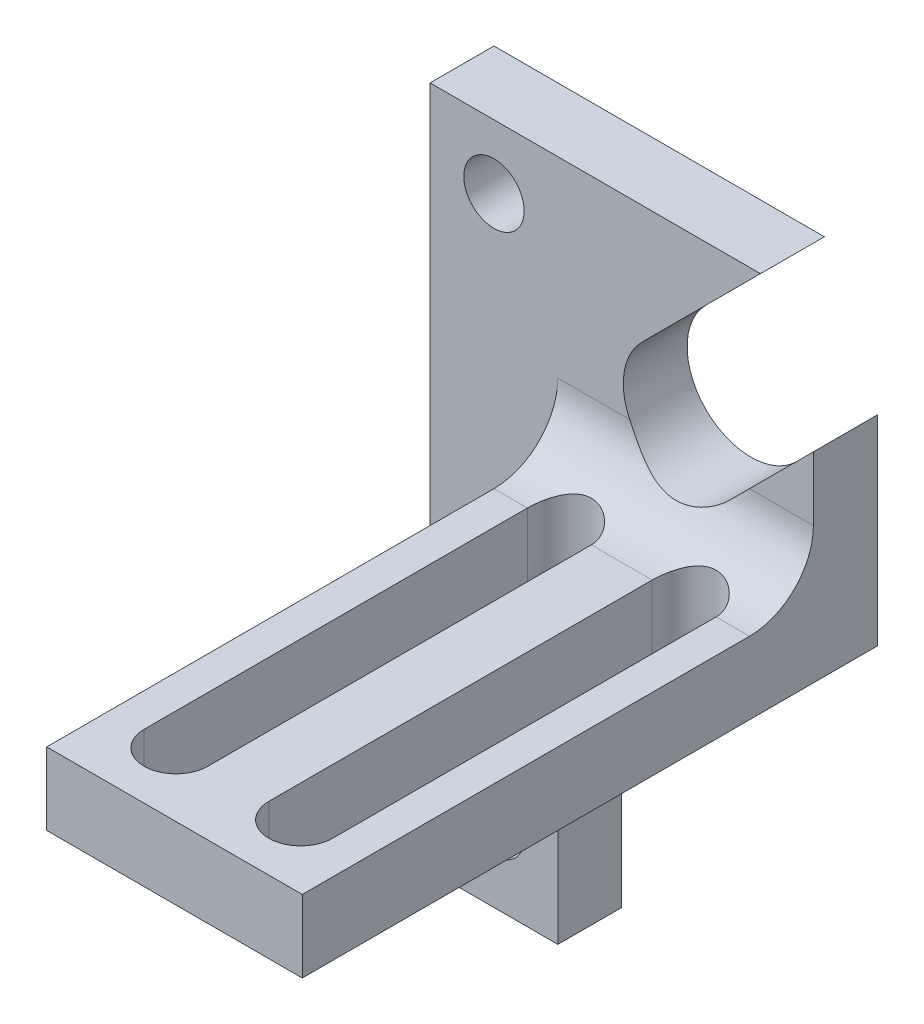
ISO-10303-21;
HEADER;
FILE_DESCRIPTION(('STEP AP214'),'2;1');
FILE_NAME('part.step','',(''),(''),'','','');
FILE_SCHEMA(('AUTOMOTIVE_DESIGN { 1 0 10303 214 1 1 1 1 }'));
ENDSEC;
DATA;
#1=APPLICATION_CONTEXT('core data for automotive mechanical design processes');
#2=APPLICATION_PROTOCOL_DEFINITION('international standard','automotive_design',2000,#1);
#3=PRODUCT_CONTEXT('',#1,'mechanical');
#4=PRODUCT('Part','Part','',(#3));
#5=PRODUCT_RELATED_PRODUCT_CATEGORY('part','',(#4));
#6=PRODUCT_DEFINITION_FORMATION('','',#4);
#7=PRODUCT_DEFINITION_CONTEXT('part definition',#1,'design');
#8=PRODUCT_DEFINITION('design','',#6,#7);
#9=PRODUCT_DEFINITION_SHAPE('','',#8);
#10=(LENGTH_UNIT() NAMED_UNIT(*) SI_UNIT(.MILLI.,.METRE.));
#11=(NAMED_UNIT(*) PLANE_ANGLE_UNIT() SI_UNIT($,.RADIAN.));
#12=(NAMED_UNIT(*) SI_UNIT($,.STERADIAN.) SOLID_ANGLE_UNIT());
#13=UNCERTAINTY_MEASURE_WITH_UNIT(LENGTH_MEASURE(1.E-05),#10,'distance_accuracy_value','');
#14=(GEOMETRIC_REPRESENTATION_CONTEXT(3) GLOBAL_UNCERTAINTY_ASSIGNED_CONTEXT((#13)) GLOBAL_UNIT_ASSIGNED_CONTEXT((#10,
#11,#12)) REPRESENTATION_CONTEXT('',''));
#15=CARTESIAN_POINT('',(0.,0.,0.));
#16=DIRECTION('',(0.,0.,1.));
#17=DIRECTION('',(1.,0.,0.));
#18=AXIS2_PLACEMENT_3D('',#15,#16,#17);
#19=CARTESIAN_POINT('',(-5.00375408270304,-19.1239826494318,12.7));
#20=DIRECTION('',(-1.,0.,0.));
#21=DIRECTION('',(0.,-1.,0.));
#22=AXIS2_PLACEMENT_3D('',#19,#20,#21);
#23=CYLINDRICAL_SURFACE('',#22,6.35);
#24=CARTESIAN_POINT('',(-23.2614148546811,-19.1239826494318,6.35));
#25=CARTESIAN_POINT('',(-23.1884676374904,-19.2737946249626,6.34997558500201));
#26=CARTESIAN_POINT('',(-23.1096050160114,-19.4206151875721,6.35529939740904));
#27=CARTESIAN_POINT('',(-22.9410293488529,-19.7069764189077,6.37519951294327));
#28=CARTESIAN_POINT('',(-22.8513313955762,-19.8465268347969,6.38976306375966));
#29=CARTESIAN_POINT('',(-22.6625957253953,-20.1164169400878,6.42656301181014));
#30=CARTESIAN_POINT('',(-22.5636359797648,-20.2468197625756,6.448738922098));
#31=CARTESIAN_POINT('',(-22.3565929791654,-20.4989302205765,6.49931056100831));
#32=CARTESIAN_POINT('',(-22.2485066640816,-20.6206349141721,6.52770838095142));
#33=CARTESIAN_POINT('',(-22.0245667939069,-20.8541816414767,6.5890741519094));
#34=CARTESIAN_POINT('',(-21.9087559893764,-20.9660711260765,6.62201787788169));
#35=CARTESIAN_POINT('',(-21.6695619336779,-21.180282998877,6.69110640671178));
#36=CARTESIAN_POINT('',(-21.5461793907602,-21.2826062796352,6.7272509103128));
#37=CARTESIAN_POINT('',(-21.1647799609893,-21.575364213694,6.83852865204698));
#38=CARTESIAN_POINT('',(-20.8960483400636,-21.7510293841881,6.91634663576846));
#39=CARTESIAN_POINT('',(-20.2990845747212,-22.0795966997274,7.07644615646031));
#40=CARTESIAN_POINT('',(-19.9676039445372,-22.2269981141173,7.15808976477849));
#41=CARTESIAN_POINT('',(-19.452447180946,-22.4047601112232,7.26274917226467));
#42=CARTESIAN_POINT('',(-19.2778238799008,-22.456776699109,7.29465732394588));
#43=CARTESIAN_POINT('',(-18.923509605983,-22.5458194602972,7.35057806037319));
#44=CARTESIAN_POINT('',(-18.7438194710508,-22.582848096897,7.37459194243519));
#45=CARTESIAN_POINT('',(-18.3917889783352,-22.639535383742,7.41185562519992));
#46=CARTESIAN_POINT('',(-18.2196541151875,-22.6601025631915,7.42566459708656));
#47=CARTESIAN_POINT('',(-17.8737742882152,-22.6870825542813,7.4438521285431));
#48=CARTESIAN_POINT('',(-17.7000294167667,-22.69349617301,7.448231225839));
#49=CARTESIAN_POINT('',(-17.3526850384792,-22.6920457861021,7.44724596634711));
#50=CARTESIAN_POINT('',(-17.1790855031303,-22.6841862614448,7.44188466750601));
#51=CARTESIAN_POINT('',(-16.833666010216,-22.6543492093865,7.42180598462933));
#52=CARTESIAN_POINT('',(-16.6618459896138,-22.6323721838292,7.40708893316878));
#53=CARTESIAN_POINT('',(-16.3451682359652,-22.5786969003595,7.37193121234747));
#54=CARTESIAN_POINT('',(-16.1998839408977,-22.5487756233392,7.35257116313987));
#55=CARTESIAN_POINT('',(-15.912504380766,-22.4790825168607,7.30857167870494));
#56=CARTESIAN_POINT('',(-15.7704101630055,-22.439307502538,7.28393053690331));
#57=CARTESIAN_POINT('',(-15.3496677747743,-22.3056295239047,7.20359533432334));
#58=CARTESIAN_POINT('',(-15.0766223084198,-22.1973843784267,7.14149720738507));
#59=CARTESIAN_POINT('',(-14.6643309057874,-22.0002346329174,7.03818776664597));
#60=CARTESIAN_POINT('',(-14.5184545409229,-21.9233312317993,6.99961095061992));
#61=CARTESIAN_POINT('',(-14.2332743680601,-21.7585458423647,6.92159979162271));
#62=CARTESIAN_POINT('',(-14.0939712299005,-21.6706627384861,6.88216536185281));
#63=CARTESIAN_POINT('',(-13.6870509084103,-21.3912024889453,6.76511542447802));
#64=CARTESIAN_POINT('',(-13.4297844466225,-21.1835086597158,6.68858047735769));
#65=CARTESIAN_POINT('',(-13.0774244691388,-20.8502444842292,6.58814352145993));
#66=CARTESIAN_POINT('',(-12.9691357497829,-20.7401000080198,6.55797131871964));
#67=CARTESIAN_POINT('',(-12.7603370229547,-20.5115445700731,6.50234024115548));
#68=CARTESIAN_POINT('',(-12.6598246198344,-20.3931361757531,6.47687991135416));
#69=CARTESIAN_POINT('',(-12.4668475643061,-20.1480145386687,6.43187111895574));
#70=CARTESIAN_POINT('',(-12.3744189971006,-20.021268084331,6.41234828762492));
#71=CARTESIAN_POINT('',(-12.1987237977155,-19.7605156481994,6.38061395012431));
#72=CARTESIAN_POINT('',(-12.115467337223,-19.6265018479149,6.36841049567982));
#73=CARTESIAN_POINT('',(-12.0372156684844,-19.4892902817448,6.36051655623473));
#74=B_SPLINE_CURVE_WITH_KNOTS('',3,(#24,#25,#26,#27,#28,#29,#30,#31,#32,#33,#34,#35,#36,#37,#38,
#39,#40,#41,#42,#43,#44,#45,#46,#47,#48,#49,#50,#51,#52,#53,#54,#55,#56,#57,#58,#59,#60,#61,#62,
#63,#64,#65,#66,#67,#68,#69,#70,#71,#72,#73),.UNSPECIFIED.,.F.,.F.,(4,2,2,2,2,2,2,2,2,2,2,2,2,2,
2,2,2,2,2,2,2,2,2,2,4),(0.,0.49952447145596,0.998361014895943,1.49332224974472,1.98845010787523,
2.48103460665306,2.97357309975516,3.96099686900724,5.07051978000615,5.62476867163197,
6.17892643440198,6.69985045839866,7.22074477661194,7.74147559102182,8.26218789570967,
8.71048463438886,9.15892645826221,10.0559996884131,10.5636665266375,11.071384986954,
12.0846567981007,12.5564451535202,13.028087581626,13.5017380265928,13.9759085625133),.UNSPECIFIED.);
#75=CARTESIAN_POINT('',(-23.2614148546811,-19.1239826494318,6.35));
#76=VERTEX_POINT('',#75);
#77=CARTESIAN_POINT('',(-13.062725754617,-20.8329543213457,6.58428942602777));
#78=VERTEX_POINT('',#77);
#79=EDGE_CURVE('E434',#76,#78,#74,.T.);
#80=ORIENTED_EDGE('',*,*,#79,.F.);
#81=DIRECTION('',(-1.,0.,0.));
#82=VECTOR('',#81,1.);
#83=CARTESIAN_POINT('',(-17.5528538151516,-19.1239826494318,6.35));
#84=LINE('',#83,#82);
#85=CARTESIAN_POINT('',(-30.403754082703,-19.1239826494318,6.35));
#86=VERTEX_POINT('',#85);
#87=EDGE_CURVE('E351',#86,#76,#84,.F.);
#88=ORIENTED_EDGE('',*,*,#87,.F.);
#89=CARTESIAN_POINT('',(-30.403754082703,-19.1239826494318,12.7));
#90=DIRECTION('',(-1.,0.,0.));
#91=DIRECTION('',(0.,0.,1.));
#92=AXIS2_PLACEMENT_3D('',#89,#90,#91);
#93=CIRCLE('',#92,6.35);
#94=CARTESIAN_POINT('',(-30.403754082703,-25.4739826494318,12.7));
#95=VERTEX_POINT('',#94);
#96=EDGE_CURVE('E43',#86,#95,#93,.T.);
#97=ORIENTED_EDGE('',*,*,#96,.T.);
#98=DIRECTION('',(-1.,0.,0.));
#99=VECTOR('',#98,1.);
#100=CARTESIAN_POINT('',(-5.00375408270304,-25.4739826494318,12.7));
#101=LINE('',#100,#99);
#102=CARTESIAN_POINT('',(-27.0778538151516,-25.4739826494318,12.7));
#103=VERTEX_POINT('',#102);
#104=EDGE_CURVE('E335',#103,#95,#101,.T.);
#105=ORIENTED_EDGE('',*,*,#104,.F.);
#106=CARTESIAN_POINT('',(-20.7278538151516,-25.4739826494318,12.7));
#107=CARTESIAN_POINT('',(-20.727840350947,-25.4739975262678,12.6161868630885));
#108=CARTESIAN_POINT('',(-20.7311721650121,-25.4723236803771,12.5323832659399));
#109=CARTESIAN_POINT('',(-20.7444217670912,-25.4657101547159,12.3654607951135));
#110=CARTESIAN_POINT('',(-20.7543369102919,-25.4607717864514,12.2823416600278));
#111=CARTESIAN_POINT('',(-20.7805893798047,-25.4477700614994,12.1177575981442));
#112=CARTESIAN_POINT('',(-20.7968975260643,-25.4397209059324,12.0362868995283));
#113=CARTESIAN_POINT('',(-20.8357353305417,-25.4207125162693,11.8752078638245));
#114=CARTESIAN_POINT('',(-20.858265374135,-25.4097531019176,11.7955996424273));
#115=CARTESIAN_POINT('',(-20.934794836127,-25.3729198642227,11.5605632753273));
#116=CARTESIAN_POINT('',(-20.9977897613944,-25.3430620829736,11.4085777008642));
#117=CARTESIAN_POINT('',(-21.1455040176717,-25.275450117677,11.1174756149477));
#118=CARTESIAN_POINT('',(-21.2302450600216,-25.2376880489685,10.978372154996));
#119=CARTESIAN_POINT('',(-21.4248269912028,-25.1550918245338,10.7076616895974));
#120=CARTESIAN_POINT('',(-21.5358685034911,-25.1099693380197,10.5770047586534));
#121=CARTESIAN_POINT('',(-21.7772644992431,-25.0186830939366,10.3353150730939));
#122=CARTESIAN_POINT('',(-21.9076315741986,-24.9725186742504,10.2242952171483));
#123=CARTESIAN_POINT('',(-22.1962764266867,-24.8802184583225,10.0163110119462));
#124=CARTESIAN_POINT('',(-22.3559351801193,-24.8343630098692,9.92110649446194));
#125=CARTESIAN_POINT('',(-22.607406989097,-24.7731790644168,9.79980415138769));
#126=CARTESIAN_POINT('',(-22.6932580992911,-24.7540459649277,9.76294561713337));
#127=CARTESIAN_POINT('',(-22.8684416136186,-24.7190283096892,9.69677421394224));
#128=CARTESIAN_POINT('',(-22.9577719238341,-24.7031418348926,9.66745688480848));
#129=CARTESIAN_POINT('',(-23.133863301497,-24.6761089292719,9.61825766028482));
#130=CARTESIAN_POINT('',(-23.2204624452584,-24.6647372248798,9.59791922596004));
#131=CARTESIAN_POINT('',(-23.3954367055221,-24.6459196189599,9.56454473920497));
#132=CARTESIAN_POINT('',(-23.4838108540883,-24.6384716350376,9.55150481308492));
#133=CARTESIAN_POINT('',(-23.6615549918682,-24.6278216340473,9.53292326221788));
#134=CARTESIAN_POINT('',(-23.7509243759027,-24.6246171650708,9.52737730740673));
#135=CARTESIAN_POINT('',(-23.9298323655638,-24.6225805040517,9.52385216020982));
#136=CARTESIAN_POINT('',(-24.0193709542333,-24.6237478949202,9.52587224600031));
#137=CARTESIAN_POINT('',(-24.265604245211,-24.632974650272,9.54188087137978));
#138=CARTESIAN_POINT('',(-24.4217006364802,-24.6455916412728,9.56378822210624));
#139=CARTESIAN_POINT('',(-24.7275053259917,-24.6826483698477,9.62996393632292));
#140=CARTESIAN_POINT('',(-24.8772117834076,-24.7070914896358,9.67423869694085));
#141=CARTESIAN_POINT('',(-25.1703927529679,-24.7655604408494,9.7846830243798));
#142=CARTESIAN_POINT('',(-25.3136411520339,-24.7997960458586,9.85133815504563));
#143=CARTESIAN_POINT('',(-25.5876101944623,-24.8740123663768,10.0042854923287));
#144=CARTESIAN_POINT('',(-25.7183242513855,-24.9139960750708,10.0905879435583));
#145=CARTESIAN_POINT('',(-25.9809663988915,-25.0013282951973,10.2931487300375));
#146=CARTESIAN_POINT('',(-26.1109462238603,-25.048967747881,10.4118180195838));
#147=CARTESIAN_POINT('',(-26.3499480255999,-25.1421237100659,10.669416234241));
#148=CARTESIAN_POINT('',(-26.4589622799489,-25.1876394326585,10.8083525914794));
#149=CARTESIAN_POINT('',(-26.6577918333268,-25.2740352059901,11.1109371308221));
#150=CARTESIAN_POINT('',(-26.7464712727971,-25.314599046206,11.2754369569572));
#151=CARTESIAN_POINT('',(-26.8571930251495,-25.366494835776,11.533256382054));
#152=CARTESIAN_POINT('',(-26.8903854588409,-25.3823024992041,11.6210471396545));
#153=CARTESIAN_POINT('',(-26.9489847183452,-25.4104857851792,11.7997064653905));
#154=CARTESIAN_POINT('',(-26.9743959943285,-25.4228633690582,11.8905732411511));
#155=CARTESIAN_POINT('',(-27.0152758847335,-25.4429032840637,12.0668077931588));
#156=CARTESIAN_POINT('',(-27.0314051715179,-25.4508765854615,12.1519879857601));
#157=CARTESIAN_POINT('',(-27.0566598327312,-25.463402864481,12.3236279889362));
#158=CARTESIAN_POINT('',(-27.0657858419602,-25.4679561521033,12.4100876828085));
#159=CARTESIAN_POINT('',(-27.0769345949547,-25.4735205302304,12.5839950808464));
#160=CARTESIAN_POINT('',(-27.0789230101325,-25.4745145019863,12.6714455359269));
#161=CARTESIAN_POINT('',(-27.0756945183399,-25.4729057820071,12.8462112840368));
#162=CARTESIAN_POINT('',(-27.0704750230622,-25.4703017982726,12.9335265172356));
#163=CARTESIAN_POINT('',(-27.0616475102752,-25.4658950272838,13.020386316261));
#164=B_SPLINE_CURVE_WITH_KNOTS('',3,(#106,#107,#108,#109,#110,#111,#112,#113,#114,#115,#116,
#117,#118,#119,#120,#121,#122,#123,#124,#125,#126,#127,#128,#129,#130,#131,#132,#133,#134,#135,
#136,#137,#138,#139,#140,#141,#142,#143,#144,#145,#146,#147,#148,#149,#150,#151,#152,#153,#154,
#155,#156,#157,#158,#159,#160,#161,#162,#163),.UNSPECIFIED.,.F.,.F.,(4,2,2,2,2,2,2,2,2,2,2,2,2,
2,2,2,2,2,2,2,2,2,2,2,2,2,2,2,4),(0.,0.251340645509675,0.5025803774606,0.752686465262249,
1.0028080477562,1.50201018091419,2.00171267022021,2.5313872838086,3.06140853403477,
3.63256941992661,3.91833593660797,4.20393304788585,4.47258889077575,4.74110200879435,
5.00945991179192,5.2777922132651,5.74974314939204,6.2218291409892,6.70490167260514,
7.18822666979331,7.73284564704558,8.27766484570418,8.84795528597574,9.13313718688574,
9.41815568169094,9.67899103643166,9.93980274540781,10.2018671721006,10.4640257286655),.UNSPECIFIED.);
#165=CARTESIAN_POINT('',(-20.7278538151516,-25.4739826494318,12.7));
#166=VERTEX_POINT('',#165);
#167=EDGE_CURVE('E361',#166,#103,#164,.T.);
#168=ORIENTED_EDGE('',*,*,#167,.F.);
#169=DIRECTION('',(-1.,0.,0.));
#170=VECTOR('',#169,1.);
#171=CARTESIAN_POINT('',(-5.00375408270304,-25.4739826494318,12.7));
#172=LINE('',#171,#170);
#173=CARTESIAN_POINT('',(-14.6796543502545,-25.4739826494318,12.7));
#174=VERTEX_POINT('',#173);
#175=EDGE_CURVE('E342',#174,#166,#172,.T.);
#176=ORIENTED_EDGE('',*,*,#175,.F.);
#177=CARTESIAN_POINT('',(-8.32965435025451,-25.4739826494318,12.7));
#178=CARTESIAN_POINT('',(-8.32964088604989,-25.4739975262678,12.6161868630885));
#179=CARTESIAN_POINT('',(-8.33297270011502,-25.4723236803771,12.5323832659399));
#180=CARTESIAN_POINT('',(-8.34622230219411,-25.4657101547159,12.3654607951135));
#181=CARTESIAN_POINT('',(-8.35613744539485,-25.4607717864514,12.2823416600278));
#182=CARTESIAN_POINT('',(-8.38238991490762,-25.4477700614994,12.1177575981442));
#183=CARTESIAN_POINT('',(-8.39869806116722,-25.4397209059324,12.0362868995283));
#184=CARTESIAN_POINT('',(-8.43753586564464,-25.4207125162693,11.8752078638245));
#185=CARTESIAN_POINT('',(-8.46006590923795,-25.4097531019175,11.7955996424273));
#186=CARTESIAN_POINT('',(-8.53659537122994,-25.3729198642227,11.5605632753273));
#187=CARTESIAN_POINT('',(-8.59959029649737,-25.3430620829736,11.4085777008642));
#188=CARTESIAN_POINT('',(-8.74730455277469,-25.275450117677,11.1174756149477));
#189=CARTESIAN_POINT('',(-8.83204559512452,-25.2376880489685,10.978372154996));
#190=CARTESIAN_POINT('',(-9.02662752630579,-25.1550918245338,10.7076616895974));
#191=CARTESIAN_POINT('',(-9.13766903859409,-25.1099693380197,10.5770047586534));
#192=CARTESIAN_POINT('',(-9.37906503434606,-25.0186830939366,10.3353150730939));
#193=CARTESIAN_POINT('',(-9.50943210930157,-24.9725186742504,10.2242952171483));
#194=CARTESIAN_POINT('',(-9.79807696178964,-24.8802184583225,10.0163110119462));
#195=CARTESIAN_POINT('',(-9.95773571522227,-24.8343630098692,9.92110649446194));
#196=CARTESIAN_POINT('',(-10.2092075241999,-24.7731790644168,9.79980415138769));
#197=CARTESIAN_POINT('',(-10.2950586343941,-24.7540459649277,9.76294561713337));
#198=CARTESIAN_POINT('',(-10.4702421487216,-24.7190283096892,9.69677421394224));
#199=CARTESIAN_POINT('',(-10.559572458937,-24.7031418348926,9.66745688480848));
#200=CARTESIAN_POINT('',(-10.7356638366,-24.6761089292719,9.61825766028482));
#201=CARTESIAN_POINT('',(-10.8222629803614,-24.6647372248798,9.59791922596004));
#202=CARTESIAN_POINT('',(-10.9972372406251,-24.6459196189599,9.56454473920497));
#203=CARTESIAN_POINT('',(-11.0856113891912,-24.6384716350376,9.55150481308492));
#204=CARTESIAN_POINT('',(-11.2633555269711,-24.6278216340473,9.53292326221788));
#205=CARTESIAN_POINT('',(-11.3527249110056,-24.6246171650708,9.52737730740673));
#206=CARTESIAN_POINT('',(-11.5316329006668,-24.6225805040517,9.52385216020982));
#207=CARTESIAN_POINT('',(-11.6211714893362,-24.6237478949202,9.52587224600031));
#208=CARTESIAN_POINT('',(-11.8674047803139,-24.632974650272,9.54188087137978));
#209=CARTESIAN_POINT('',(-12.0235011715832,-24.6455916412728,9.56378822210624));
#210=CARTESIAN_POINT('',(-12.3293058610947,-24.6826483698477,9.62996393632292));
#211=CARTESIAN_POINT('',(-12.4790123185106,-24.7070914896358,9.67423869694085));
#212=CARTESIAN_POINT('',(-12.7721932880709,-24.7655604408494,9.7846830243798));
#213=CARTESIAN_POINT('',(-12.9154416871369,-24.7997960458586,9.85133815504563));
#214=CARTESIAN_POINT('',(-13.1894107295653,-24.8740123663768,10.0042854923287));
#215=CARTESIAN_POINT('',(-13.3201247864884,-24.9139960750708,10.0905879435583));
#216=CARTESIAN_POINT('',(-13.5827669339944,-25.0013282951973,10.2931487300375));
#217=CARTESIAN_POINT('',(-13.7127467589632,-25.048967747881,10.4118180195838));
#218=CARTESIAN_POINT('',(-13.9517485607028,-25.1421237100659,10.669416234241));
#219=CARTESIAN_POINT('',(-14.0607628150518,-25.1876394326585,10.8083525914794));
#220=CARTESIAN_POINT('',(-14.2595923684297,-25.2740352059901,11.1109371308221));
#221=CARTESIAN_POINT('',(-14.3482718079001,-25.314599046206,11.2754369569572));
#222=CARTESIAN_POINT('',(-14.4589935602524,-25.366494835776,11.533256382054));
#223=CARTESIAN_POINT('',(-14.4921859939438,-25.3823024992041,11.6210471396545));
#224=CARTESIAN_POINT('',(-14.5507852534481,-25.4104857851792,11.7997064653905));
#225=CARTESIAN_POINT('',(-14.5761965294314,-25.4228633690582,11.8905732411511));
#226=CARTESIAN_POINT('',(-14.6170764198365,-25.4429032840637,12.0668077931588));
#227=CARTESIAN_POINT('',(-14.6332057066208,-25.4508765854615,12.1519879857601));
#228=CARTESIAN_POINT('',(-14.6584603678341,-25.463402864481,12.3236279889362));
#229=CARTESIAN_POINT('',(-14.6675863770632,-25.4679561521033,12.4100876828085));
#230=CARTESIAN_POINT('',(-14.6787351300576,-25.4735205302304,12.5839950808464));
#231=CARTESIAN_POINT('',(-14.6807235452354,-25.4745145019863,12.6714455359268));
#232=CARTESIAN_POINT('',(-14.6774950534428,-25.4729057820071,12.8462112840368));
#233=CARTESIAN_POINT('',(-14.6722755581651,-25.4703017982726,12.9335265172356));
#234=CARTESIAN_POINT('',(-14.6634480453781,-25.4658950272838,13.020386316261));
#235=B_SPLINE_CURVE_WITH_KNOTS('',3,(#177,#178,#179,#180,#181,#182,#183,#184,#185,#186,#187,
#188,#189,#190,#191,#192,#193,#194,#195,#196,#197,#198,#199,#200,#201,#202,#203,#204,#205,#206,
#207,#208,#209,#210,#211,#212,#213,#214,#215,#216,#217,#218,#219,#220,#221,#222,#223,#224,#225,
#226,#227,#228,#229,#230,#231,#232,#233,#234),.UNSPECIFIED.,.F.,.F.,(4,2,2,2,2,2,2,2,2,2,2,2,2,
2,2,2,2,2,2,2,2,2,2,2,2,2,2,2,4),(0.,0.251340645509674,0.502580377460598,0.752686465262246,
1.0028080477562,1.50201018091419,2.00171267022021,2.5313872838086,3.06140853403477,
3.63256941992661,3.91833593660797,4.20393304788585,4.47258889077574,4.74110200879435,
5.00945991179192,5.2777922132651,5.74974314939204,6.2218291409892,6.70490167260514,
7.18822666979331,7.73284564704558,8.27766484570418,8.84795528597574,9.13313718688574,
9.41815568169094,9.67899103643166,9.9398027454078,10.2018671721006,10.4640257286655),.UNSPECIFIED.);
#236=CARTESIAN_POINT('',(-8.32965435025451,-25.4739826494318,12.7));
#237=VERTEX_POINT('',#236);
#238=EDGE_CURVE('E354',#237,#174,#235,.T.);
#239=ORIENTED_EDGE('',*,*,#238,.F.);
#240=DIRECTION('',(-1.,0.,0.));
#241=VECTOR('',#240,1.);
#242=CARTESIAN_POINT('',(-5.00375408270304,-25.4739826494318,12.7));
#243=LINE('',#242,#241);
#244=CARTESIAN_POINT('',(-5.00375408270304,-25.4739826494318,12.7));
#245=VERTEX_POINT('',#244);
#246=EDGE_CURVE('E345',#245,#237,#243,.T.);
#247=ORIENTED_EDGE('',*,*,#246,.F.);
#248=CARTESIAN_POINT('',(-5.00375408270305,-19.1239826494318,12.7));
#249=DIRECTION('',(1.,0.,0.));
#250=DIRECTION('',(0.,1.,0.));
#251=AXIS2_PLACEMENT_3D('',#248,#249,#250);
#252=CIRCLE('',#251,6.35);
#253=CARTESIAN_POINT('',(-5.00375408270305,-19.1239826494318,6.35));
#254=VERTEX_POINT('',#253);
#255=EDGE_CURVE('E439',#245,#254,#252,.T.);
#256=ORIENTED_EDGE('',*,*,#255,.T.);
#257=DIRECTION('',(-1.,0.,0.));
#258=VECTOR('',#257,1.);
#259=CARTESIAN_POINT('',(-17.5528538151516,-19.1239826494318,6.35));
#260=LINE('',#259,#258);
#261=CARTESIAN_POINT('',(-11.353754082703,-19.1239826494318,6.35));
#262=VERTEX_POINT('',#261);
#263=EDGE_CURVE('E348',#262,#254,#260,.F.);
#264=ORIENTED_EDGE('',*,*,#263,.F.);
#265=CARTESIAN_POINT('',(-11.353754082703,-19.1239826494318,12.7));
#266=DIRECTION('',(-0.707106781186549,0.707106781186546,0.));
#267=DIRECTION('',(-0.707106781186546,-0.707106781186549,0.));
#268=AXIS2_PLACEMENT_3D('',#265,#266,#267);
#269=ELLIPSE('',#268,8.98025612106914,6.35);
#270=EDGE_CURVE('E440',#78,#262,#269,.F.);
#271=ORIENTED_EDGE('',*,*,#270,.F.);
#272=EDGE_LOOP('',(#80,#88,#97,#105,#168,#176,#239,#247,#256,#264,#271));
#273=FACE_BOUND('',#272,.T.);
#274=ADVANCED_FACE('F39',(#273),#23,.F.);
#275=CARTESIAN_POINT('',(-17.5528538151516,-16.3428262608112,6.35));
#276=DIRECTION('',(0.,0.,1.));
#277=DIRECTION('',(1.,0.,0.));
#278=AXIS2_PLACEMENT_3D('',#275,#276,#277);
#279=PLANE('',#278);
#280=CARTESIAN_POINT('',(-36.7537540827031,-60.4239826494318,6.35));
#281=DIRECTION('',(0.,0.,1.));
#282=DIRECTION('',(1.,0.,0.));
#283=AXIS2_PLACEMENT_3D('',#280,#281,#282);
#284=CIRCLE('',#283,3.);
#285=CARTESIAN_POINT('',(-33.753754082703,-60.4239826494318,6.35));
#286=VERTEX_POINT('',#285);
#287=EDGE_CURVE('E219',#286,#286,#284,.T.);
#288=ORIENTED_EDGE('',*,*,#287,.F.);
#289=EDGE_LOOP('',(#288));
#290=FACE_BOUND('',#289,.T.);
#291=CARTESIAN_POINT('',(-36.753754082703,-6.42398264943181,6.35));
#292=DIRECTION('',(0.,0.,1.));
#293=DIRECTION('',(1.,0.,0.));
#294=AXIS2_PLACEMENT_3D('',#291,#292,#293);
#295=CIRCLE('',#294,3.);
#296=CARTESIAN_POINT('',(-33.753754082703,-6.42398264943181,6.35));
#297=VERTEX_POINT('',#296);
#298=EDGE_CURVE('E511',#297,#297,#295,.T.);
#299=ORIENTED_EDGE('',*,*,#298,.F.);
#300=EDGE_LOOP('',(#299));
#301=FACE_BOUND('',#300,.T.);
#302=DIRECTION('',(1.,0.,0.));
#303=VECTOR('',#302,1.);
#304=CARTESIAN_POINT('',(-30.403754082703,-0.0739826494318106,6.35));
#305=LINE('',#304,#303);
#306=CARTESIAN_POINT('',(-43.103754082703,-0.0739826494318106,6.35));
#307=VERTEX_POINT('',#306);
#308=CARTESIAN_POINT('',(-10.2642663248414,-0.0739826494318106,6.35));
#309=VERTEX_POINT('',#308);
#310=EDGE_CURVE('E193',#307,#309,#305,.T.);
#311=ORIENTED_EDGE('',*,*,#310,.F.);
#312=DIRECTION('',(0.,-1.,0.));
#313=VECTOR('',#312,1.);
#314=CARTESIAN_POINT('',(-43.103754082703,-0.0739826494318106,6.35));
#315=LINE('',#314,#313);
#316=CARTESIAN_POINT('',(-43.103754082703,-67.873271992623,6.35));
#317=VERTEX_POINT('',#316);
#318=EDGE_CURVE('E185',#307,#317,#315,.T.);
#319=ORIENTED_EDGE('',*,*,#318,.T.);
#320=DIRECTION('',(1.,0.,0.));
#321=VECTOR('',#320,1.);
#322=CARTESIAN_POINT('',(-43.103754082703,-67.873271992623,6.35));
#323=LINE('',#322,#321);
#324=CARTESIAN_POINT('',(-30.403754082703,-67.873271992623,6.35));
#325=VERTEX_POINT('',#324);
#326=EDGE_CURVE('E190',#317,#325,#323,.T.);
#327=ORIENTED_EDGE('',*,*,#326,.T.);
#328=DIRECTION('',(0.,1.,0.));
#329=VECTOR('',#328,1.);
#330=CARTESIAN_POINT('',(-30.403754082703,-67.873271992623,6.35));
#331=LINE('',#330,#329);
#332=CARTESIAN_POINT('',(-30.403754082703,-32.6642798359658,6.35));
#333=VERTEX_POINT('',#332);
#334=EDGE_CURVE('E49',#325,#333,#331,.T.);
#335=ORIENTED_EDGE('',*,*,#334,.T.);
#336=EDGE_CURVE('E11',#333,#86,#331,.T.);
#337=ORIENTED_EDGE('',*,*,#336,.T.);
#338=ORIENTED_EDGE('',*,*,#87,.T.);
#339=CARTESIAN_POINT('',(-17.5528538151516,-16.3428262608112,6.35));
#340=DIRECTION('',(0.,0.,1.));
#341=DIRECTION('',(1.,0.,0.));
#342=AXIS2_PLACEMENT_3D('',#339,#340,#341);
#343=CIRCLE('',#342,6.35);
#344=CARTESIAN_POINT('',(-22.0429818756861,-11.8526982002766,6.35));
#345=VERTEX_POINT('',#344);
#346=EDGE_CURVE('E312',#345,#76,#343,.T.);
#347=ORIENTED_EDGE('',*,*,#346,.F.);
#348=DIRECTION('',(0.707106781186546,0.707106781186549,0.));
#349=VECTOR('',#348,1.);
#350=CARTESIAN_POINT('',(-22.0429818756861,-11.8526982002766,6.35));
#351=LINE('',#350,#349);
#352=EDGE_CURVE('E309',#345,#309,#351,.T.);
#353=ORIENTED_EDGE('',*,*,#352,.T.);
#354=EDGE_LOOP('',(#311,#319,#327,#335,#337,#338,#347,#353));
#355=FACE_BOUND('',#354,.T.);
#356=ADVANCED_FACE('F187',(#290,#301,#355),#279,.T.);
#357=CARTESIAN_POINT('',(-5.00375408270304,-25.4739826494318,57.15));
#358=DIRECTION('',(0.,-1.,0.));
#359=DIRECTION('',(1.,0.,0.));
#360=AXIS2_PLACEMENT_3D('',#357,#358,#359);
#361=PLANE('',#360);
#362=DIRECTION('',(0.,0.,-1.));
#363=VECTOR('',#362,1.);
#364=CARTESIAN_POINT('',(-5.00375408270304,-25.4739826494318,57.15));
#365=LINE('',#364,#363);
#366=CARTESIAN_POINT('',(-5.00375408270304,-25.4739826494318,57.15));
#367=VERTEX_POINT('',#366);
#368=EDGE_CURVE('E293',#367,#245,#365,.T.);
#369=ORIENTED_EDGE('',*,*,#368,.T.);
#370=ORIENTED_EDGE('',*,*,#246,.T.);
#371=DIRECTION('',(0.,0.,-1.));
#372=VECTOR('',#371,1.);
#373=CARTESIAN_POINT('',(-8.3296543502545,-25.4739826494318,50.8));
#374=LINE('',#373,#372);
#375=CARTESIAN_POINT('',(-8.32965435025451,-25.4739826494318,50.8));
#376=VERTEX_POINT('',#375);
#377=EDGE_CURVE('E237',#376,#237,#374,.T.);
#378=ORIENTED_EDGE('',*,*,#377,.F.);
#379=CARTESIAN_POINT('',(-11.5046543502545,-25.4739826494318,50.8));
#380=DIRECTION('',(0.,-1.,0.));
#381=DIRECTION('',(1.,0.,0.));
#382=AXIS2_PLACEMENT_3D('',#379,#380,#381);
#383=CIRCLE('',#382,3.175);
#384=CARTESIAN_POINT('',(-14.6796543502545,-25.4739826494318,50.8));
#385=VERTEX_POINT('',#384);
#386=EDGE_CURVE('E228',#376,#385,#383,.T.);
#387=ORIENTED_EDGE('',*,*,#386,.T.);
#388=DIRECTION('',(0.,0.,-1.));
#389=VECTOR('',#388,1.);
#390=CARTESIAN_POINT('',(-14.6796543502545,-25.4739826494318,50.8));
#391=LINE('',#390,#389);
#392=EDGE_CURVE('E240',#385,#174,#391,.T.);
#393=ORIENTED_EDGE('',*,*,#392,.T.);
#394=ORIENTED_EDGE('',*,*,#175,.T.);
#395=DIRECTION('',(0.,0.,-1.));
#396=VECTOR('',#395,1.);
#397=CARTESIAN_POINT('',(-20.7278538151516,-25.4739826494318,50.8));
#398=LINE('',#397,#396);
#399=CARTESIAN_POINT('',(-20.7278538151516,-25.4739826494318,50.8));
#400=VERTEX_POINT('',#399);
#401=EDGE_CURVE('E270',#400,#166,#398,.T.);
#402=ORIENTED_EDGE('',*,*,#401,.F.);
#403=CARTESIAN_POINT('',(-23.9028538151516,-25.4739826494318,50.8));
#404=DIRECTION('',(0.,1.,0.));
#405=DIRECTION('',(-1.,0.,0.));
#406=AXIS2_PLACEMENT_3D('',#403,#404,#405);
#407=CIRCLE('',#406,3.175);
#408=CARTESIAN_POINT('',(-27.0778538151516,-25.4739826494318,50.8));
#409=VERTEX_POINT('',#408);
#410=EDGE_CURVE('E267',#409,#400,#407,.T.);
#411=ORIENTED_EDGE('',*,*,#410,.F.);
#412=DIRECTION('',(0.,0.,-1.));
#413=VECTOR('',#412,1.);
#414=CARTESIAN_POINT('',(-27.0778538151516,-25.4739826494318,50.8));
#415=LINE('',#414,#413);
#416=EDGE_CURVE('E241',#409,#103,#415,.T.);
#417=ORIENTED_EDGE('',*,*,#416,.T.);
#418=ORIENTED_EDGE('',*,*,#104,.T.);
#419=DIRECTION('',(0.,0.,-1.));
#420=VECTOR('',#419,1.);
#421=CARTESIAN_POINT('',(-30.403754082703,-25.4739826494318,57.15));
#422=LINE('',#421,#420);
#423=CARTESIAN_POINT('',(-30.403754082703,-25.4739826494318,57.15));
#424=VERTEX_POINT('',#423);
#425=EDGE_CURVE('E304',#424,#95,#422,.T.);
#426=ORIENTED_EDGE('',*,*,#425,.F.);
#427=DIRECTION('',(-1.,0.,0.));
#428=VECTOR('',#427,1.);
#429=CARTESIAN_POINT('',(-5.00375408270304,-25.4739826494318,57.15));
#430=LINE('',#429,#428);
#431=EDGE_CURVE('E284',#367,#424,#430,.T.);
#432=ORIENTED_EDGE('',*,*,#431,.F.);
#433=EDGE_LOOP('',(#369,#370,#378,#387,#393,#394,#402,#411,#417,#418,#426,#432));
#434=FACE_BOUND('',#433,.T.);
#435=ADVANCED_FACE('F407',(#434),#361,.F.);
#436=CARTESIAN_POINT('',(-30.403754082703,-32.6642798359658,57.15));
#437=DIRECTION('',(0.,1.,0.));
#438=DIRECTION('',(0.,0.,1.));
#439=AXIS2_PLACEMENT_3D('',#436,#437,#438);
#440=PLANE('',#439);
#441=CARTESIAN_POINT('',(-11.5046543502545,-32.6642798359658,50.8));
#442=DIRECTION('',(0.,-1.,0.));
#443=DIRECTION('',(1.,0.,0.));
#444=AXIS2_PLACEMENT_3D('',#441,#442,#443);
#445=CIRCLE('',#444,3.175);
#446=CARTESIAN_POINT('',(-8.32965435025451,-32.6642798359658,50.8));
#447=VERTEX_POINT('',#446);
#448=CARTESIAN_POINT('',(-14.6796543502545,-32.6642798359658,50.8));
#449=VERTEX_POINT('',#448);
#450=EDGE_CURVE('E234',#447,#449,#445,.T.);
#451=ORIENTED_EDGE('',*,*,#450,.F.);
#452=DIRECTION('',(0.,0.,-1.));
#453=VECTOR('',#452,1.);
#454=CARTESIAN_POINT('',(-8.3296543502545,-32.6642798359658,50.8));
#455=LINE('',#454,#453);
#456=CARTESIAN_POINT('',(-8.32965435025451,-32.6642798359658,12.7));
#457=VERTEX_POINT('',#456);
#458=EDGE_CURVE('E224',#447,#457,#455,.T.);
#459=ORIENTED_EDGE('',*,*,#458,.T.);
#460=CARTESIAN_POINT('',(-11.5046543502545,-32.6642798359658,12.7));
#461=DIRECTION('',(0.,1.,0.));
#462=DIRECTION('',(-1.,0.,0.));
#463=AXIS2_PLACEMENT_3D('',#460,#461,#462);
#464=CIRCLE('',#463,3.175);
#465=CARTESIAN_POINT('',(-14.6796543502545,-32.6642798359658,12.7));
#466=VERTEX_POINT('',#465);
#467=EDGE_CURVE('E227',#457,#466,#464,.T.);
#468=ORIENTED_EDGE('',*,*,#467,.T.);
#469=DIRECTION('',(0.,0.,-1.));
#470=VECTOR('',#469,1.);
#471=CARTESIAN_POINT('',(-14.6796543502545,-32.6642798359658,50.8));
#472=LINE('',#471,#470);
#473=EDGE_CURVE('E231',#449,#466,#472,.T.);
#474=ORIENTED_EDGE('',*,*,#473,.F.);
#475=EDGE_LOOP('',(#451,#459,#468,#474));
#476=FACE_BOUND('',#475,.T.);
#477=DIRECTION('',(1.,0.,0.));
#478=VECTOR('',#477,1.);
#479=CARTESIAN_POINT('',(-30.403754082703,-32.6642798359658,0.));
#480=LINE('',#479,#478);
#481=CARTESIAN_POINT('',(-30.403754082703,-32.6642798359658,0.));
#482=VERTEX_POINT('',#481);
#483=CARTESIAN_POINT('',(-5.00375408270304,-32.6642798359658,0.));
#484=VERTEX_POINT('',#483);
#485=EDGE_CURVE('E248',#482,#484,#480,.T.);
#486=ORIENTED_EDGE('',*,*,#485,.T.);
#487=DIRECTION('',(0.,0.,-1.));
#488=VECTOR('',#487,1.);
#489=CARTESIAN_POINT('',(-5.00375408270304,-32.6642798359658,57.15));
#490=LINE('',#489,#488);
#491=CARTESIAN_POINT('',(-5.00375408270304,-32.6642798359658,57.15));
#492=VERTEX_POINT('',#491);
#493=EDGE_CURVE('E298',#492,#484,#490,.T.);
#494=ORIENTED_EDGE('',*,*,#493,.F.);
#495=DIRECTION('',(1.,0.,0.));
#496=VECTOR('',#495,1.);
#497=CARTESIAN_POINT('',(-30.403754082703,-32.6642798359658,57.15));
#498=LINE('',#497,#496);
#499=CARTESIAN_POINT('',(-30.403754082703,-32.6642798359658,57.15));
#500=VERTEX_POINT('',#499);
#501=EDGE_CURVE('E289',#500,#492,#498,.T.);
#502=ORIENTED_EDGE('',*,*,#501,.F.);
#503=DIRECTION('',(0.,0.,-1.));
#504=VECTOR('',#503,1.);
#505=CARTESIAN_POINT('',(-30.403754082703,-32.6642798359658,57.15));
#506=LINE('',#505,#504);
#507=EDGE_CURVE('E302',#500,#333,#506,.T.);
#508=ORIENTED_EDGE('',*,*,#507,.T.);
#509=EDGE_CURVE('E301',#333,#482,#506,.T.);
#510=ORIENTED_EDGE('',*,*,#509,.T.);
#511=EDGE_LOOP('',(#486,#494,#502,#508,#510));
#512=FACE_BOUND('',#511,.T.);
#513=DIRECTION('',(0.,0.,-1.));
#514=VECTOR('',#513,1.);
#515=CARTESIAN_POINT('',(-27.0778538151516,-32.6642798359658,50.8));
#516=LINE('',#515,#514);
#517=CARTESIAN_POINT('',(-27.0778538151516,-32.6642798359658,50.8));
#518=VERTEX_POINT('',#517);
#519=CARTESIAN_POINT('',(-27.0778538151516,-32.6642798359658,12.7));
#520=VERTEX_POINT('',#519);
#521=EDGE_CURVE('E271',#518,#520,#516,.T.);
#522=ORIENTED_EDGE('',*,*,#521,.F.);
#523=CARTESIAN_POINT('',(-23.9028538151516,-32.6642798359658,50.8));
#524=DIRECTION('',(0.,1.,0.));
#525=DIRECTION('',(-1.,0.,0.));
#526=AXIS2_PLACEMENT_3D('',#523,#524,#525);
#527=CIRCLE('',#526,3.175);
#528=CARTESIAN_POINT('',(-20.7278538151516,-32.6642798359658,50.8));
#529=VERTEX_POINT('',#528);
#530=EDGE_CURVE('E266',#518,#529,#527,.T.);
#531=ORIENTED_EDGE('',*,*,#530,.T.);
#532=DIRECTION('',(0.,0.,-1.));
#533=VECTOR('',#532,1.);
#534=CARTESIAN_POINT('',(-20.7278538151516,-32.6642798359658,50.8));
#535=LINE('',#534,#533);
#536=CARTESIAN_POINT('',(-20.7278538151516,-32.6642798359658,12.7));
#537=VERTEX_POINT('',#536);
#538=EDGE_CURVE('E278',#529,#537,#535,.T.);
#539=ORIENTED_EDGE('',*,*,#538,.T.);
#540=CARTESIAN_POINT('',(-23.9028538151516,-32.6642798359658,12.7));
#541=DIRECTION('',(0.,-1.,0.));
#542=DIRECTION('',(1.,0.,0.));
#543=AXIS2_PLACEMENT_3D('',#540,#541,#542);
#544=CIRCLE('',#543,3.175);
#545=EDGE_CURVE('E281',#520,#537,#544,.T.);
#546=ORIENTED_EDGE('',*,*,#545,.F.);
#547=EDGE_LOOP('',(#522,#531,#539,#546));
#548=FACE_BOUND('',#547,.T.);
#549=ADVANCED_FACE('F403',(#476,#512,#548),#440,.F.);
#550=CARTESIAN_POINT('',(-5.00375408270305,-12.7739826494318,6.35));
#551=DIRECTION('',(1.,0.,0.));
#552=DIRECTION('',(0.,1.,0.));
#553=AXIS2_PLACEMENT_3D('',#550,#551,#552);
#554=PLANE('',#553);
#555=DIRECTION('',(0.,-1.,0.));
#556=VECTOR('',#555,1.);
#557=CARTESIAN_POINT('',(-5.00375408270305,-12.7739826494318,0.));
#558=LINE('',#557,#556);
#559=CARTESIAN_POINT('',(-5.00375408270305,-12.7739826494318,0.));
#560=VERTEX_POINT('',#559);
#561=EDGE_CURVE('E310',#560,#484,#558,.T.);
#562=ORIENTED_EDGE('',*,*,#561,.F.);
#563=DIRECTION('',(0.,0.,-1.));
#564=VECTOR('',#563,1.);
#565=CARTESIAN_POINT('',(-5.00375408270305,-12.7739826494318,6.35));
#566=LINE('',#565,#564);
#567=CARTESIAN_POINT('',(-5.00375408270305,-12.7739826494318,6.35));
#568=VERTEX_POINT('',#567);
#569=EDGE_CURVE('E333',#568,#560,#566,.T.);
#570=ORIENTED_EDGE('',*,*,#569,.F.);
#571=DIRECTION('',(0.,-1.,0.));
#572=VECTOR('',#571,1.);
#573=CARTESIAN_POINT('',(-5.00375408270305,-12.7739826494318,6.35));
#574=LINE('',#573,#572);
#575=EDGE_CURVE('E317',#568,#254,#574,.T.);
#576=ORIENTED_EDGE('',*,*,#575,.T.);
#577=ORIENTED_EDGE('',*,*,#255,.F.);
#578=ORIENTED_EDGE('',*,*,#368,.F.);
#579=DIRECTION('',(0.,1.,0.));
#580=VECTOR('',#579,1.);
#581=CARTESIAN_POINT('',(-5.00375408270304,-32.6642798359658,57.15));
#582=LINE('',#581,#580);
#583=EDGE_CURVE('E291',#492,#367,#582,.T.);
#584=ORIENTED_EDGE('',*,*,#583,.F.);
#585=ORIENTED_EDGE('',*,*,#493,.T.);
#586=EDGE_LOOP('',(#562,#570,#576,#577,#578,#584,#585));
#587=FACE_BOUND('',#586,.T.);
#588=ADVANCED_FACE('F406',(#587),#554,.T.);
#589=CARTESIAN_POINT('',(-13.062725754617,-20.8329543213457,6.35));
#590=DIRECTION('',(-0.707106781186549,0.707106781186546,0.));
#591=DIRECTION('',(-0.707106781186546,-0.707106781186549,0.));
#592=AXIS2_PLACEMENT_3D('',#589,#590,#591);
#593=PLANE('',#592);
#594=DIRECTION('',(0.707106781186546,0.707106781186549,0.));
#595=VECTOR('',#594,1.);
#596=CARTESIAN_POINT('',(-13.062725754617,-20.8329543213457,0.));
#597=LINE('',#596,#595);
#598=CARTESIAN_POINT('',(-13.062725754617,-20.8329543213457,0.));
#599=VERTEX_POINT('',#598);
#600=EDGE_CURVE('E329',#599,#560,#597,.T.);
#601=ORIENTED_EDGE('',*,*,#600,.F.);
#602=DIRECTION('',(0.,0.,-1.));
#603=VECTOR('',#602,1.);
#604=CARTESIAN_POINT('',(-13.062725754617,-20.8329543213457,6.35));
#605=LINE('',#604,#603);
#606=EDGE_CURVE('E62',#78,#599,#605,.T.);
#607=ORIENTED_EDGE('',*,*,#606,.F.);
#608=ORIENTED_EDGE('',*,*,#270,.T.);
#609=DIRECTION('',(0.707106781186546,0.707106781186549,0.));
#610=VECTOR('',#609,1.);
#611=CARTESIAN_POINT('',(-13.062725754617,-20.8329543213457,6.35));
#612=LINE('',#611,#610);
#613=EDGE_CURVE('E315',#262,#568,#612,.T.);
#614=ORIENTED_EDGE('',*,*,#613,.T.);
#615=ORIENTED_EDGE('',*,*,#569,.T.);
#616=EDGE_LOOP('',(#601,#607,#608,#614,#615));
#617=FACE_BOUND('',#616,.T.);
#618=ADVANCED_FACE('F422',(#617),#593,.T.);
#619=CARTESIAN_POINT('',(-17.5528538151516,-16.3428262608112,6.35));
#620=DIRECTION('',(0.,0.,-1.));
#621=DIRECTION('',(-1.,0.,0.));
#622=AXIS2_PLACEMENT_3D('',#619,#620,#621);
#623=CYLINDRICAL_SURFACE('',#622,6.35);
#624=CARTESIAN_POINT('',(-17.5528538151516,-16.3428262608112,0.));
#625=DIRECTION('',(0.,0.,1.));
#626=DIRECTION('',(1.,0.,0.));
#627=AXIS2_PLACEMENT_3D('',#624,#625,#626);
#628=CIRCLE('',#627,6.35);
#629=CARTESIAN_POINT('',(-22.0429818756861,-11.8526982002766,0.));
#630=VERTEX_POINT('',#629);
#631=EDGE_CURVE('E326',#630,#599,#628,.T.);
#632=ORIENTED_EDGE('',*,*,#631,.F.);
#633=DIRECTION('',(0.,0.,-1.));
#634=VECTOR('',#633,1.);
#635=CARTESIAN_POINT('',(-22.0429818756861,-11.8526982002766,6.35));
#636=LINE('',#635,#634);
#637=EDGE_CURVE('E337',#345,#630,#636,.T.);
#638=ORIENTED_EDGE('',*,*,#637,.F.);
#639=ORIENTED_EDGE('',*,*,#346,.T.);
#640=ORIENTED_EDGE('',*,*,#79,.T.);
#641=ORIENTED_EDGE('',*,*,#606,.T.);
#642=EDGE_LOOP('',(#632,#638,#639,#640,#641));
#643=FACE_BOUND('',#642,.T.);
#644=ADVANCED_FACE('F426',(#643),#623,.F.);
#645=CARTESIAN_POINT('',(-22.0429818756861,-11.8526982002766,6.35));
#646=DIRECTION('',(-0.707106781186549,0.707106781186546,0.));
#647=DIRECTION('',(-0.707106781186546,-0.707106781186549,0.));
#648=AXIS2_PLACEMENT_3D('',#645,#646,#647);
#649=PLANE('',#648);
#650=DIRECTION('',(0.707106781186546,0.707106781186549,0.));
#651=VECTOR('',#650,1.);
#652=CARTESIAN_POINT('',(-22.0429818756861,-11.8526982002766,0.));
#653=LINE('',#652,#651);
#654=CARTESIAN_POINT('',(-10.2642663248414,-0.0739826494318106,0.));
#655=VERTEX_POINT('',#654);
#656=EDGE_CURVE('E323',#630,#655,#653,.T.);
#657=ORIENTED_EDGE('',*,*,#656,.T.);
#658=DIRECTION('',(0.,0.,-1.));
#659=VECTOR('',#658,1.);
#660=CARTESIAN_POINT('',(-10.2642663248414,-0.0739826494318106,6.35));
#661=LINE('',#660,#659);
#662=EDGE_CURVE('E320',#309,#655,#661,.T.);
#663=ORIENTED_EDGE('',*,*,#662,.F.);
#664=ORIENTED_EDGE('',*,*,#352,.F.);
#665=ORIENTED_EDGE('',*,*,#637,.T.);
#666=EDGE_LOOP('',(#657,#663,#664,#665));
#667=FACE_BOUND('',#666,.T.);
#668=ADVANCED_FACE('F430',(#667),#649,.F.);
#669=CARTESIAN_POINT('',(-30.403754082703,-0.0739826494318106,6.35));
#670=DIRECTION('',(0.,1.,0.));
#671=DIRECTION('',(0.,0.,1.));
#672=AXIS2_PLACEMENT_3D('',#669,#670,#671);
#673=PLANE('',#672);
#674=DIRECTION('',(1.,0.,0.));
#675=VECTOR('',#674,1.);
#676=CARTESIAN_POINT('',(-30.403754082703,-0.0739826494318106,0.));
#677=LINE('',#676,#675);
#678=CARTESIAN_POINT('',(-43.103754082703,-0.0739826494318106,0.));
#679=VERTEX_POINT('',#678);
#680=EDGE_CURVE('E307',#679,#655,#677,.T.);
#681=ORIENTED_EDGE('',*,*,#680,.F.);
#682=DIRECTION('',(0.,0.,-1.));
#683=VECTOR('',#682,1.);
#684=CARTESIAN_POINT('',(-43.103754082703,-0.0739826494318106,6.35));
#685=LINE('',#684,#683);
#686=EDGE_CURVE('E214',#307,#679,#685,.T.);
#687=ORIENTED_EDGE('',*,*,#686,.F.);
#688=ORIENTED_EDGE('',*,*,#310,.T.);
#689=ORIENTED_EDGE('',*,*,#662,.T.);
#690=EDGE_LOOP('',(#681,#687,#688,#689));
#691=FACE_BOUND('',#690,.T.);
#692=ADVANCED_FACE('F484',(#691),#673,.T.);
#693=CARTESIAN_POINT('',(-30.403754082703,-25.4739826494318,6.35));
#694=DIRECTION('',(-1.,0.,0.));
#695=DIRECTION('',(0.,0.,1.));
#696=AXIS2_PLACEMENT_3D('',#693,#694,#695);
#697=PLANE('',#696);
#698=ORIENTED_EDGE('',*,*,#336,.F.);
#699=ORIENTED_EDGE('',*,*,#507,.F.);
#700=DIRECTION('',(0.,-1.,0.));
#701=VECTOR('',#700,1.);
#702=CARTESIAN_POINT('',(-30.403754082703,-25.4739826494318,57.15));
#703=LINE('',#702,#701);
#704=EDGE_CURVE('E287',#424,#500,#703,.T.);
#705=ORIENTED_EDGE('',*,*,#704,.F.);
#706=ORIENTED_EDGE('',*,*,#425,.T.);
#707=ORIENTED_EDGE('',*,*,#96,.F.);
#708=EDGE_LOOP('',(#698,#699,#705,#706,#707));
#709=FACE_BOUND('',#708,.T.);
#710=ADVANCED_FACE('F415',(#709),#697,.T.);
#711=ORIENTED_EDGE('',*,*,#613,.F.);
#712=ORIENTED_EDGE('',*,*,#263,.T.);
#713=ORIENTED_EDGE('',*,*,#575,.F.);
#714=EDGE_LOOP('',(#711,#712,#713));
#715=FACE_BOUND('',#714,.T.);
#716=ADVANCED_FACE('F412',(#715),#279,.T.);
#717=CARTESIAN_POINT('',(-17.5528538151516,-16.3428262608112,0.));
#718=DIRECTION('',(0.,0.,1.));
#719=DIRECTION('',(1.,0.,0.));
#720=AXIS2_PLACEMENT_3D('',#717,#718,#719);
#721=PLANE('',#720);
#722=CARTESIAN_POINT('',(-36.7537540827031,-60.4239826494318,0.));
#723=DIRECTION('',(0.,0.,-1.));
#724=DIRECTION('',(-1.,0.,0.));
#725=AXIS2_PLACEMENT_3D('',#722,#723,#724);
#726=CIRCLE('',#725,3.);
#727=CARTESIAN_POINT('',(-39.7537540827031,-60.4239826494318,0.));
#728=VERTEX_POINT('',#727);
#729=EDGE_CURVE('E513',#728,#728,#726,.T.);
#730=ORIENTED_EDGE('',*,*,#729,.F.);
#731=EDGE_LOOP('',(#730));
#732=FACE_BOUND('',#731,.T.);
#733=CARTESIAN_POINT('',(-36.753754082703,-6.42398264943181,0.));
#734=DIRECTION('',(0.,0.,-1.));
#735=DIRECTION('',(-1.,0.,0.));
#736=AXIS2_PLACEMENT_3D('',#733,#734,#735);
#737=CIRCLE('',#736,3.);
#738=CARTESIAN_POINT('',(-39.753754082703,-6.42398264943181,0.));
#739=VERTEX_POINT('',#738);
#740=EDGE_CURVE('E516',#739,#739,#737,.T.);
#741=ORIENTED_EDGE('',*,*,#740,.F.);
#742=EDGE_LOOP('',(#741));
#743=FACE_BOUND('',#742,.T.);
#744=ORIENTED_EDGE('',*,*,#561,.T.);
#745=ORIENTED_EDGE('',*,*,#485,.F.);
#746=DIRECTION('',(0.,-1.,0.));
#747=VECTOR('',#746,1.);
#748=CARTESIAN_POINT('',(-30.403754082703,-0.0739826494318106,0.));
#749=LINE('',#748,#747);
#750=CARTESIAN_POINT('',(-30.403754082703,-67.873271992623,0.));
#751=VERTEX_POINT('',#750);
#752=EDGE_CURVE('E197',#482,#751,#749,.T.);
#753=ORIENTED_EDGE('',*,*,#752,.T.);
#754=DIRECTION('',(1.,0.,0.));
#755=VECTOR('',#754,1.);
#756=CARTESIAN_POINT('',(-43.103754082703,-67.873271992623,0.));
#757=LINE('',#756,#755);
#758=CARTESIAN_POINT('',(-43.103754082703,-67.873271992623,0.));
#759=VERTEX_POINT('',#758);
#760=EDGE_CURVE('E218',#759,#751,#757,.T.);
#761=ORIENTED_EDGE('',*,*,#760,.F.);
#762=DIRECTION('',(0.,-1.,0.));
#763=VECTOR('',#762,1.);
#764=CARTESIAN_POINT('',(-43.103754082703,-10.723271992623,0.));
#765=LINE('',#764,#763);
#766=EDGE_CURVE('E203',#679,#759,#765,.T.);
#767=ORIENTED_EDGE('',*,*,#766,.F.);
#768=ORIENTED_EDGE('',*,*,#680,.T.);
#769=ORIENTED_EDGE('',*,*,#656,.F.);
#770=ORIENTED_EDGE('',*,*,#631,.T.);
#771=ORIENTED_EDGE('',*,*,#600,.T.);
#772=EDGE_LOOP('',(#744,#745,#753,#761,#767,#768,#769,#770,#771));
#773=FACE_BOUND('',#772,.T.);
#774=ADVANCED_FACE('F401',(#732,#743,#773),#721,.F.);
#775=CARTESIAN_POINT('',(0.,0.,57.15));
#776=DIRECTION('',(0.,0.,1.));
#777=DIRECTION('',(1.,0.,0.));
#778=AXIS2_PLACEMENT_3D('',#775,#776,#777);
#779=PLANE('',#778);
#780=ORIENTED_EDGE('',*,*,#431,.T.);
#781=ORIENTED_EDGE('',*,*,#704,.T.);
#782=ORIENTED_EDGE('',*,*,#501,.T.);
#783=ORIENTED_EDGE('',*,*,#583,.T.);
#784=EDGE_LOOP('',(#780,#781,#782,#783));
#785=FACE_BOUND('',#784,.T.);
#786=ADVANCED_FACE('F386',(#785),#779,.T.);
#787=CARTESIAN_POINT('',(-27.0778538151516,-32.6642798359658,50.8));
#788=DIRECTION('',(1.,0.,0.));
#789=DIRECTION('',(0.,1.,0.));
#790=AXIS2_PLACEMENT_3D('',#787,#788,#789);
#791=PLANE('',#790);
#792=ORIENTED_EDGE('',*,*,#416,.F.);
#793=DIRECTION('',(0.,1.,0.));
#794=VECTOR('',#793,1.);
#795=CARTESIAN_POINT('',(-27.0778538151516,-32.6642798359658,50.8));
#796=LINE('',#795,#794);
#797=EDGE_CURVE('E263',#518,#409,#796,.T.);
#798=ORIENTED_EDGE('',*,*,#797,.F.);
#799=ORIENTED_EDGE('',*,*,#521,.T.);
#800=DIRECTION('',(0.,1.,0.));
#801=VECTOR('',#800,1.);
#802=CARTESIAN_POINT('',(-27.0778538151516,-32.6642798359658,12.7));
#803=LINE('',#802,#801);
#804=EDGE_CURVE('E207',#520,#103,#803,.T.);
#805=ORIENTED_EDGE('',*,*,#804,.T.);
#806=EDGE_LOOP('',(#792,#798,#799,#805));
#807=FACE_BOUND('',#806,.T.);
#808=ADVANCED_FACE('F383',(#807),#791,.T.);
#809=CARTESIAN_POINT('',(-23.9028538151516,-32.6642798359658,12.7));
#810=DIRECTION('',(0.,1.,0.));
#811=DIRECTION('',(-1.,0.,0.));
#812=AXIS2_PLACEMENT_3D('',#809,#810,#811);
#813=CYLINDRICAL_SURFACE('',#812,3.175);
#814=DIRECTION('',(0.,1.,0.));
#815=VECTOR('',#814,1.);
#816=CARTESIAN_POINT('',(-20.7278538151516,-32.6642798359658,12.7));
#817=LINE('',#816,#815);
#818=EDGE_CURVE('E258',#537,#166,#817,.T.);
#819=ORIENTED_EDGE('',*,*,#818,.T.);
#820=ORIENTED_EDGE('',*,*,#167,.T.);
#821=ORIENTED_EDGE('',*,*,#804,.F.);
#822=ORIENTED_EDGE('',*,*,#545,.T.);
#823=EDGE_LOOP('',(#819,#820,#821,#822));
#824=FACE_BOUND('',#823,.T.);
#825=ADVANCED_FACE('F385',(#824),#813,.F.);
#826=CARTESIAN_POINT('',(-20.7278538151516,-32.6642798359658,50.8));
#827=DIRECTION('',(1.,0.,0.));
#828=DIRECTION('',(0.,1.,0.));
#829=AXIS2_PLACEMENT_3D('',#826,#827,#828);
#830=PLANE('',#829);
#831=ORIENTED_EDGE('',*,*,#401,.T.);
#832=ORIENTED_EDGE('',*,*,#818,.F.);
#833=ORIENTED_EDGE('',*,*,#538,.F.);
#834=DIRECTION('',(0.,1.,0.));
#835=VECTOR('',#834,1.);
#836=CARTESIAN_POINT('',(-20.7278538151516,-32.6642798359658,50.8));
#837=LINE('',#836,#835);
#838=EDGE_CURVE('E261',#529,#400,#837,.T.);
#839=ORIENTED_EDGE('',*,*,#838,.T.);
#840=EDGE_LOOP('',(#831,#832,#833,#839));
#841=FACE_BOUND('',#840,.T.);
#842=ADVANCED_FACE('F391',(#841),#830,.F.);
#843=CARTESIAN_POINT('',(-23.9028538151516,-32.6642798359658,50.8));
#844=DIRECTION('',(0.,1.,0.));
#845=DIRECTION('',(-1.,0.,0.));
#846=AXIS2_PLACEMENT_3D('',#843,#844,#845);
#847=CYLINDRICAL_SURFACE('',#846,3.175);
#848=ORIENTED_EDGE('',*,*,#410,.T.);
#849=ORIENTED_EDGE('',*,*,#838,.F.);
#850=ORIENTED_EDGE('',*,*,#530,.F.);
#851=ORIENTED_EDGE('',*,*,#797,.T.);
#852=EDGE_LOOP('',(#848,#849,#850,#851));
#853=FACE_BOUND('',#852,.T.);
#854=ADVANCED_FACE('F381',(#853),#847,.F.);
#855=CARTESIAN_POINT('',(-8.3296543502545,-32.6642798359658,50.8));
#856=DIRECTION('',(1.,0.,0.));
#857=DIRECTION('',(0.,0.,-1.));
#858=AXIS2_PLACEMENT_3D('',#855,#856,#857);
#859=PLANE('',#858);
#860=ORIENTED_EDGE('',*,*,#377,.T.);
#861=DIRECTION('',(0.,1.,0.));
#862=VECTOR('',#861,1.);
#863=CARTESIAN_POINT('',(-8.32965435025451,-32.6642798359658,12.7));
#864=LINE('',#863,#862);
#865=EDGE_CURVE('E236',#457,#237,#864,.T.);
#866=ORIENTED_EDGE('',*,*,#865,.F.);
#867=ORIENTED_EDGE('',*,*,#458,.F.);
#868=DIRECTION('',(0.,1.,0.));
#869=VECTOR('',#868,1.);
#870=CARTESIAN_POINT('',(-8.32965435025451,-32.6642798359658,50.8));
#871=LINE('',#870,#869);
#872=EDGE_CURVE('E246',#447,#376,#871,.T.);
#873=ORIENTED_EDGE('',*,*,#872,.T.);
#874=EDGE_LOOP('',(#860,#866,#867,#873));
#875=FACE_BOUND('',#874,.T.);
#876=ADVANCED_FACE('F377',(#875),#859,.F.);
#877=CARTESIAN_POINT('',(-11.5046543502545,-32.6642798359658,50.8));
#878=DIRECTION('',(0.,1.,0.));
#879=DIRECTION('',(-1.,0.,0.));
#880=AXIS2_PLACEMENT_3D('',#877,#878,#879);
#881=CYLINDRICAL_SURFACE('',#880,3.175);
#882=ORIENTED_EDGE('',*,*,#386,.F.);
#883=ORIENTED_EDGE('',*,*,#872,.F.);
#884=ORIENTED_EDGE('',*,*,#450,.T.);
#885=DIRECTION('',(0.,1.,0.));
#886=VECTOR('',#885,1.);
#887=CARTESIAN_POINT('',(-14.6796543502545,-32.6642798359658,50.8));
#888=LINE('',#887,#886);
#889=EDGE_CURVE('E249',#449,#385,#888,.T.);
#890=ORIENTED_EDGE('',*,*,#889,.T.);
#891=EDGE_LOOP('',(#882,#883,#884,#890));
#892=FACE_BOUND('',#891,.T.);
#893=ADVANCED_FACE('F380',(#892),#881,.F.);
#894=CARTESIAN_POINT('',(-14.6796543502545,-32.6642798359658,50.8));
#895=DIRECTION('',(1.,0.,0.));
#896=DIRECTION('',(0.,0.,-1.));
#897=AXIS2_PLACEMENT_3D('',#894,#895,#896);
#898=PLANE('',#897);
#899=ORIENTED_EDGE('',*,*,#392,.F.);
#900=ORIENTED_EDGE('',*,*,#889,.F.);
#901=ORIENTED_EDGE('',*,*,#473,.T.);
#902=DIRECTION('',(0.,1.,0.));
#903=VECTOR('',#902,1.);
#904=CARTESIAN_POINT('',(-14.6796543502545,-32.6642798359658,12.7));
#905=LINE('',#904,#903);
#906=EDGE_CURVE('E251',#466,#174,#905,.T.);
#907=ORIENTED_EDGE('',*,*,#906,.T.);
#908=EDGE_LOOP('',(#899,#900,#901,#907));
#909=FACE_BOUND('',#908,.T.);
#910=ADVANCED_FACE('F374',(#909),#898,.T.);
#911=CARTESIAN_POINT('',(-11.5046543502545,-32.6642798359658,12.7));
#912=DIRECTION('',(0.,1.,0.));
#913=DIRECTION('',(-1.,0.,0.));
#914=AXIS2_PLACEMENT_3D('',#911,#912,#913);
#915=CYLINDRICAL_SURFACE('',#914,3.175);
#916=ORIENTED_EDGE('',*,*,#865,.T.);
#917=ORIENTED_EDGE('',*,*,#238,.T.);
#918=ORIENTED_EDGE('',*,*,#906,.F.);
#919=ORIENTED_EDGE('',*,*,#467,.F.);
#920=EDGE_LOOP('',(#916,#917,#918,#919));
#921=FACE_BOUND('',#920,.T.);
#922=ADVANCED_FACE('F368',(#921),#915,.F.);
#923=CARTESIAN_POINT('',(-30.403754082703,-0.0739826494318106,6.35));
#924=DIRECTION('',(1.,0.,0.));
#925=DIRECTION('',(0.,0.,-1.));
#926=AXIS2_PLACEMENT_3D('',#923,#924,#925);
#927=PLANE('',#926);
#928=ORIENTED_EDGE('',*,*,#509,.F.);
#929=ORIENTED_EDGE('',*,*,#334,.F.);
#930=DIRECTION('',(0.,0.,-1.));
#931=VECTOR('',#930,1.);
#932=CARTESIAN_POINT('',(-30.403754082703,-67.873271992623,6.35));
#933=LINE('',#932,#931);
#934=EDGE_CURVE('E208',#325,#751,#933,.T.);
#935=ORIENTED_EDGE('',*,*,#934,.T.);
#936=ORIENTED_EDGE('',*,*,#752,.F.);
#937=EDGE_LOOP('',(#928,#929,#935,#936));
#938=FACE_BOUND('',#937,.T.);
#939=ADVANCED_FACE('F373',(#938),#927,.T.);
#940=CARTESIAN_POINT('',(-43.103754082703,-10.723271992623,6.35));
#941=DIRECTION('',(1.,0.,0.));
#942=DIRECTION('',(0.,0.,-1.));
#943=AXIS2_PLACEMENT_3D('',#940,#941,#942);
#944=PLANE('',#943);
#945=ORIENTED_EDGE('',*,*,#766,.T.);
#946=DIRECTION('',(0.,0.,-1.));
#947=VECTOR('',#946,1.);
#948=CARTESIAN_POINT('',(-43.103754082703,-67.873271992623,6.35));
#949=LINE('',#948,#947);
#950=EDGE_CURVE('E200',#317,#759,#949,.T.);
#951=ORIENTED_EDGE('',*,*,#950,.F.);
#952=ORIENTED_EDGE('',*,*,#318,.F.);
#953=ORIENTED_EDGE('',*,*,#686,.T.);
#954=EDGE_LOOP('',(#945,#951,#952,#953));
#955=FACE_BOUND('',#954,.T.);
#956=ADVANCED_FACE('F201',(#955),#944,.F.);
#957=CARTESIAN_POINT('',(-43.103754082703,-67.873271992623,6.35));
#958=DIRECTION('',(0.,1.,0.));
#959=DIRECTION('',(0.,0.,1.));
#960=AXIS2_PLACEMENT_3D('',#957,#958,#959);
#961=PLANE('',#960);
#962=ORIENTED_EDGE('',*,*,#760,.T.);
#963=ORIENTED_EDGE('',*,*,#934,.F.);
#964=ORIENTED_EDGE('',*,*,#326,.F.);
#965=ORIENTED_EDGE('',*,*,#950,.T.);
#966=EDGE_LOOP('',(#962,#963,#964,#965));
#967=FACE_BOUND('',#966,.T.);
#968=ADVANCED_FACE('F210',(#967),#961,.F.);
#969=CARTESIAN_POINT('',(-36.753754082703,-6.42398264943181,57.15));
#970=DIRECTION('',(0.,0.,-1.));
#971=DIRECTION('',(-1.,0.,0.));
#972=AXIS2_PLACEMENT_3D('',#969,#970,#971);
#973=CYLINDRICAL_SURFACE('',#972,3.);
#974=ORIENTED_EDGE('',*,*,#298,.T.);
#975=EDGE_LOOP('',(#974));
#976=FACE_BOUND('',#975,.T.);
#977=ORIENTED_EDGE('',*,*,#740,.T.);
#978=EDGE_LOOP('',(#977));
#979=FACE_BOUND('',#978,.T.);
#980=ADVANCED_FACE('F522',(#976,#979),#973,.F.);
#981=CARTESIAN_POINT('',(-36.7537540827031,-60.4239826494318,57.15));
#982=DIRECTION('',(0.,0.,-1.));
#983=DIRECTION('',(-1.,0.,0.));
#984=AXIS2_PLACEMENT_3D('',#981,#982,#983);
#985=CYLINDRICAL_SURFACE('',#984,3.);
#986=ORIENTED_EDGE('',*,*,#287,.T.);
#987=EDGE_LOOP('',(#986));
#988=FACE_BOUND('',#987,.T.);
#989=ORIENTED_EDGE('',*,*,#729,.T.);
#990=EDGE_LOOP('',(#989));
#991=FACE_BOUND('',#990,.T.);
#992=ADVANCED_FACE('F525',(#988,#991),#985,.F.);
#993=CLOSED_SHELL('',(#274,#356,#435,#549,#588,#618,#644,#668,#692,#710,#716,#774,#786,#808,
#825,#842,#854,#876,#893,#910,#922,#939,#956,#968,#980,#992));
#994=MANIFOLD_SOLID_BREP('B2',#993);
#995=ADVANCED_BREP_SHAPE_REPRESENTATION('',(#18,#994),#14);
#996=SHAPE_DEFINITION_REPRESENTATION(#9,#995);
ENDSEC;
END-ISO-10303-21;
